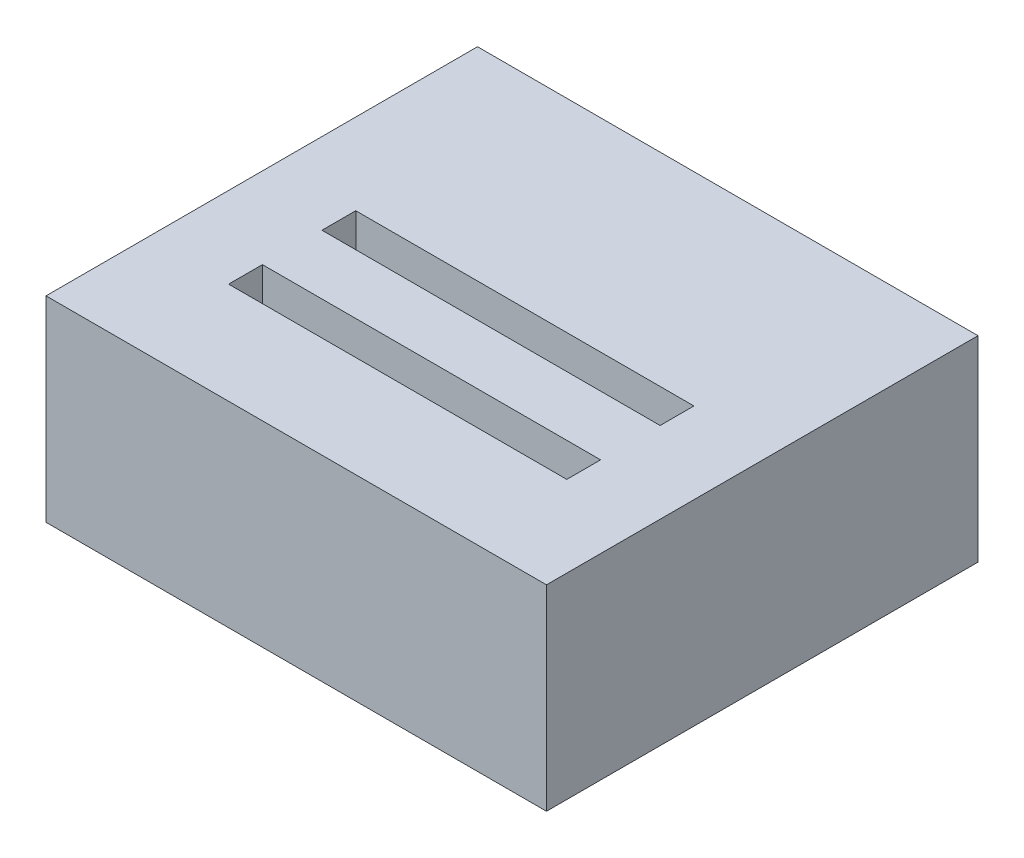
from build123d import *

# Parameters (mm, degrees)
SKETCH1_W           = 18.796
SKETCH1_H           = 7.366
BOSS_EXTRUDE1_DEPTH = 7.62
SKETCH2_R           = 0.508
CUT_EXTRUDE1_DEPTH  = 7.62
SKETCH3_W           = 3.048
SKETCH3_H           = 7.366
BOSS_EXTRUDE2_DEPTH = 1.27
SKETCH4_W           = 18.796
SKETCH4_H           = 7.366
BOSS_EXTRUDE3_DEPTH = 2.2352
SKETCH5_W           = 3.048
SKETCH5_H           = 7.366
BOSS_EXTRUDE4_DEPTH = 1.27
SKETCH6_W           = 18.796
SKETCH6_H           = 7.366
BOSS_EXTRUDE5_DEPTH = 3.81
SKETCH7_W           = 4.826
SKETCH7_H           = 7.62
BOSS_EXTRUDE6_DEPTH = 0.635


with BuildPart() as part:
    # Sketch1 → Boss-Extrude1 (new body)
    with BuildSketch(Plane.XY):
        with Locations((5.08, 1.27)):
            Rectangle(SKETCH1_W, SKETCH1_H)
    extrude(amount=BOSS_EXTRUDE1_DEPTH)

    # Sketch2 → Cut-Extrude1 (cut)
    with BuildSketch(Plane(origin=(0, 0, 0), x_dir=(-1, 0, 0), z_dir=(0, 0, -1))):
        Circle(SKETCH2_R)
        with Locations((-2.54, 0)):
            Circle(SKETCH2_R)
        with Locations((-5.08, 0)):
            Circle(SKETCH2_R)
        with Locations((-7.62, 0)):
            Circle(SKETCH2_R)
        with Locations((-10.16, 0)):
            Circle(SKETCH2_R)
        with Locations((0, 2.54)):
            Circle(SKETCH2_R)
        with Locations((-2.54, 2.54)):
            Circle(SKETCH2_R)
        with Locations((-5.08, 2.54)):
            Circle(SKETCH2_R)
        with Locations((-7.62, 2.54)):
            Circle(SKETCH2_R)
        with Locations((-10.16, 2.54)):
            Circle(SKETCH2_R)
    extrude(amount=-CUT_EXTRUDE1_DEPTH, mode=Mode.SUBTRACT)

    # Sketch3 → Boss-Extrude2 (add)
    with BuildSketch(Plane.XY.offset(7.62)):
        with Locations((-2.794, 1.27)):
            Rectangle(SKETCH3_W, SKETCH3_H)
        with Locations((12.954, 1.27)):
            Rectangle(SKETCH3_W, SKETCH3_H)
    extrude(amount=BOSS_EXTRUDE2_DEPTH)

    # Sketch4 → Boss-Extrude3 (add)
    with BuildSketch(Plane.XY.offset(8.89)):
        with Locations((5.08, 1.27)):
            Rectangle(SKETCH4_W, SKETCH4_H)
    extrude(amount=BOSS_EXTRUDE3_DEPTH)

    # Sketch5 → Boss-Extrude4 (add)
    with BuildSketch(Plane.XY.offset(11.1252)):
        with Locations((-2.794, 1.27)):
            Rectangle(SKETCH5_W, SKETCH5_H)
        with Locations((12.954, 1.27)):
            Rectangle(SKETCH5_W, SKETCH5_H)
    extrude(amount=BOSS_EXTRUDE4_DEPTH)

    # Sketch6 → Boss-Extrude5 (add)
    with BuildSketch(Plane.XY.offset(12.3952)):
        with Locations((5.08, 1.27)):
            Rectangle(SKETCH6_W, SKETCH6_H)
    extrude(amount=BOSS_EXTRUDE5_DEPTH)

    # Sketch7 → Boss-Extrude6 (add)
    with BuildSketch(Plane.XZ.offset(2.413)):
        with Locations((5.08, 3.81)):
            Rectangle(SKETCH7_W, SKETCH7_H)
    extrude(amount=BOSS_EXTRUDE6_DEPTH)


solid = part.part
